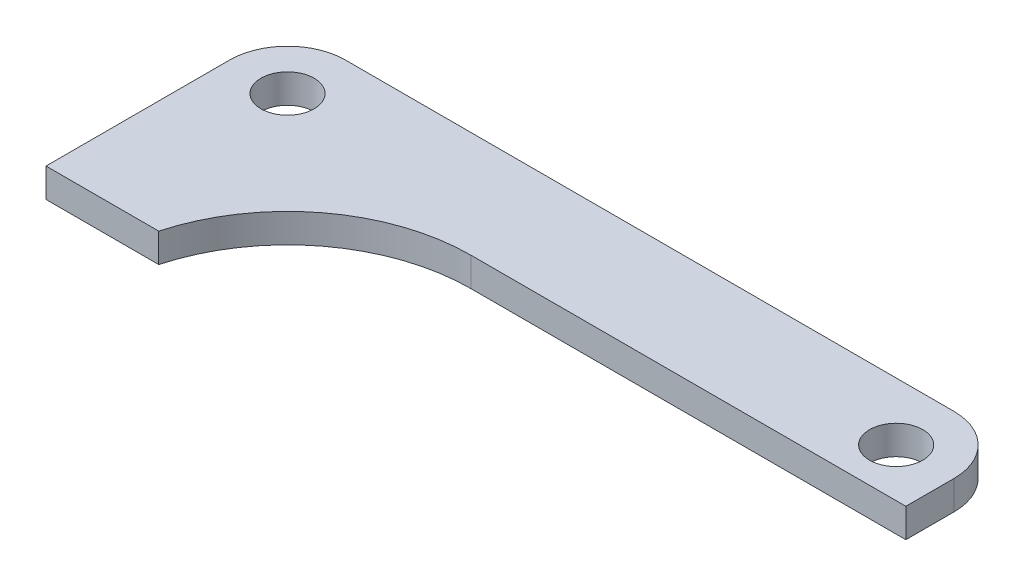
ISO-10303-21;
HEADER;
FILE_DESCRIPTION(('STEP AP214'),'2;1');
FILE_NAME('part.step','',(''),(''),'','','');
FILE_SCHEMA(('AUTOMOTIVE_DESIGN { 1 0 10303 214 1 1 1 1 }'));
ENDSEC;
DATA;
#1=APPLICATION_CONTEXT('core data for automotive mechanical design processes');
#2=APPLICATION_PROTOCOL_DEFINITION('international standard','automotive_design',2000,#1);
#3=PRODUCT_CONTEXT('',#1,'mechanical');
#4=PRODUCT('Part','Part','',(#3));
#5=PRODUCT_RELATED_PRODUCT_CATEGORY('part','',(#4));
#6=PRODUCT_DEFINITION_FORMATION('','',#4);
#7=PRODUCT_DEFINITION_CONTEXT('part definition',#1,'design');
#8=PRODUCT_DEFINITION('design','',#6,#7);
#9=PRODUCT_DEFINITION_SHAPE('','',#8);
#10=(LENGTH_UNIT() NAMED_UNIT(*) SI_UNIT(.MILLI.,.METRE.));
#11=(NAMED_UNIT(*) PLANE_ANGLE_UNIT() SI_UNIT($,.RADIAN.));
#12=(NAMED_UNIT(*) SI_UNIT($,.STERADIAN.) SOLID_ANGLE_UNIT());
#13=UNCERTAINTY_MEASURE_WITH_UNIT(LENGTH_MEASURE(1.E-05),#10,'distance_accuracy_value','');
#14=(GEOMETRIC_REPRESENTATION_CONTEXT(3) GLOBAL_UNCERTAINTY_ASSIGNED_CONTEXT((#13)) GLOBAL_UNIT_ASSIGNED_CONTEXT((#10,
#11,#12)) REPRESENTATION_CONTEXT('',''));
#15=CARTESIAN_POINT('',(0.,0.,0.));
#16=DIRECTION('',(0.,0.,1.));
#17=DIRECTION('',(1.,0.,0.));
#18=AXIS2_PLACEMENT_3D('',#15,#16,#17);
#19=CARTESIAN_POINT('',(6.,3.,-19.));
#20=DIRECTION('',(0.,-1.,0.));
#21=DIRECTION('',(0.,0.,-1.));
#22=AXIS2_PLACEMENT_3D('',#19,#20,#21);
#23=PLANE('',#22);
#24=CARTESIAN_POINT('',(6.,3.,-19.));
#25=DIRECTION('',(0.,1.,0.));
#26=DIRECTION('',(0.,0.,1.));
#27=AXIS2_PLACEMENT_3D('',#24,#25,#26);
#28=CIRCLE('',#27,2.75);
#29=CARTESIAN_POINT('',(6.,3.,-16.25));
#30=VERTEX_POINT('',#29);
#31=EDGE_CURVE('E132',#30,#30,#28,.T.);
#32=ORIENTED_EDGE('',*,*,#31,.F.);
#33=EDGE_LOOP('',(#32));
#34=FACE_BOUND('',#33,.T.);
#35=DIRECTION('',(0.,0.,1.));
#36=VECTOR('',#35,1.);
#37=CARTESIAN_POINT('',(0.,3.,0.));
#38=LINE('',#37,#36);
#39=CARTESIAN_POINT('',(0.,3.,-19.));
#40=VERTEX_POINT('',#39);
#41=CARTESIAN_POINT('',(0.,3.,0.));
#42=VERTEX_POINT('',#41);
#43=EDGE_CURVE('E143',#40,#42,#38,.T.);
#44=ORIENTED_EDGE('',*,*,#43,.T.);
#45=DIRECTION('',(1.,0.,0.));
#46=VECTOR('',#45,1.);
#47=CARTESIAN_POINT('',(0.,3.,0.));
#48=LINE('',#47,#46);
#49=CARTESIAN_POINT('',(11.6696972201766,3.,0.));
#50=VERTEX_POINT('',#49);
#51=EDGE_CURVE('E91',#42,#50,#48,.T.);
#52=ORIENTED_EDGE('',*,*,#51,.T.);
#53=CARTESIAN_POINT('',(30.,3.,5.));
#54=DIRECTION('',(0.,-1.,0.));
#55=DIRECTION('',(0.,0.,1.));
#56=AXIS2_PLACEMENT_3D('',#53,#54,#55);
#57=CIRCLE('',#56,19.);
#58=CARTESIAN_POINT('',(30.,3.,-14.));
#59=VERTEX_POINT('',#58);
#60=EDGE_CURVE('E158',#50,#59,#57,.T.);
#61=ORIENTED_EDGE('',*,*,#60,.T.);
#62=DIRECTION('',(1.,0.,0.));
#63=VECTOR('',#62,1.);
#64=CARTESIAN_POINT('',(30.,3.,-14.));
#65=LINE('',#64,#63);
#66=CARTESIAN_POINT('',(75.,3.,-14.));
#67=VERTEX_POINT('',#66);
#68=EDGE_CURVE('E171',#59,#67,#65,.T.);
#69=ORIENTED_EDGE('',*,*,#68,.T.);
#70=DIRECTION('',(0.,0.,-1.));
#71=VECTOR('',#70,1.);
#72=CARTESIAN_POINT('',(75.,3.,-14.));
#73=LINE('',#72,#71);
#74=CARTESIAN_POINT('',(75.,3.,-19.));
#75=VERTEX_POINT('',#74);
#76=EDGE_CURVE('E110',#67,#75,#73,.T.);
#77=ORIENTED_EDGE('',*,*,#76,.T.);
#78=CARTESIAN_POINT('',(69.,3.,-19.));
#79=DIRECTION('',(0.,1.,0.));
#80=DIRECTION('',(0.,0.,1.));
#81=AXIS2_PLACEMENT_3D('',#78,#79,#80);
#82=CIRCLE('',#81,6.);
#83=CARTESIAN_POINT('',(68.9999999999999,3.,-25.));
#84=VERTEX_POINT('',#83);
#85=EDGE_CURVE('E104',#75,#84,#82,.T.);
#86=ORIENTED_EDGE('',*,*,#85,.T.);
#87=DIRECTION('',(-1.,0.,0.));
#88=VECTOR('',#87,1.);
#89=CARTESIAN_POINT('',(6.00000000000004,3.,-25.));
#90=LINE('',#89,#88);
#91=CARTESIAN_POINT('',(6.00000000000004,3.,-25.));
#92=VERTEX_POINT('',#91);
#93=EDGE_CURVE('E108',#84,#92,#90,.T.);
#94=ORIENTED_EDGE('',*,*,#93,.T.);
#95=CARTESIAN_POINT('',(6.,3.,-19.));
#96=DIRECTION('',(0.,1.,0.));
#97=DIRECTION('',(0.,0.,-1.));
#98=AXIS2_PLACEMENT_3D('',#95,#96,#97);
#99=CIRCLE('',#98,6.);
#100=EDGE_CURVE('E48',#92,#40,#99,.T.);
#101=ORIENTED_EDGE('',*,*,#100,.T.);
#102=EDGE_LOOP('',(#44,#52,#61,#69,#77,#86,#94,#101));
#103=FACE_BOUND('',#102,.T.);
#104=CARTESIAN_POINT('',(69.,3.,-19.));
#105=DIRECTION('',(0.,1.,0.));
#106=DIRECTION('',(0.,0.,1.));
#107=AXIS2_PLACEMENT_3D('',#104,#105,#106);
#108=CIRCLE('',#107,2.75000000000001);
#109=CARTESIAN_POINT('',(69.,3.,-16.25));
#110=VERTEX_POINT('',#109);
#111=EDGE_CURVE('E180',#110,#110,#108,.T.);
#112=ORIENTED_EDGE('',*,*,#111,.F.);
#113=EDGE_LOOP('',(#112));
#114=FACE_BOUND('',#113,.T.);
#115=ADVANCED_FACE('F31',(#34,#103,#114),#23,.F.);
#116=CARTESIAN_POINT('',(6.,0.,-19.));
#117=DIRECTION('',(0.,-1.,0.));
#118=DIRECTION('',(0.,0.,-1.));
#119=AXIS2_PLACEMENT_3D('',#116,#117,#118);
#120=PLANE('',#119);
#121=CARTESIAN_POINT('',(6.,0.,-19.));
#122=DIRECTION('',(0.,1.,0.));
#123=DIRECTION('',(0.,0.,1.));
#124=AXIS2_PLACEMENT_3D('',#121,#122,#123);
#125=CIRCLE('',#124,2.75);
#126=CARTESIAN_POINT('',(6.,0.,-16.25));
#127=VERTEX_POINT('',#126);
#128=EDGE_CURVE('E177',#127,#127,#125,.T.);
#129=ORIENTED_EDGE('',*,*,#128,.T.);
#130=EDGE_LOOP('',(#129));
#131=FACE_BOUND('',#130,.T.);
#132=DIRECTION('',(0.,0.,1.));
#133=VECTOR('',#132,1.);
#134=CARTESIAN_POINT('',(0.,0.,0.));
#135=LINE('',#134,#133);
#136=CARTESIAN_POINT('',(0.,0.,-19.));
#137=VERTEX_POINT('',#136);
#138=CARTESIAN_POINT('',(0.,0.,0.));
#139=VERTEX_POINT('',#138);
#140=EDGE_CURVE('E128',#137,#139,#135,.T.);
#141=ORIENTED_EDGE('',*,*,#140,.F.);
#142=CARTESIAN_POINT('',(6.,0.,-19.));
#143=DIRECTION('',(0.,1.,0.));
#144=DIRECTION('',(0.,0.,-1.));
#145=AXIS2_PLACEMENT_3D('',#142,#143,#144);
#146=CIRCLE('',#145,6.);
#147=CARTESIAN_POINT('',(6.00000000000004,0.,-25.));
#148=VERTEX_POINT('',#147);
#149=EDGE_CURVE('E83',#148,#137,#146,.T.);
#150=ORIENTED_EDGE('',*,*,#149,.F.);
#151=DIRECTION('',(-1.,0.,0.));
#152=VECTOR('',#151,1.);
#153=CARTESIAN_POINT('',(6.00000000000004,0.,-25.));
#154=LINE('',#153,#152);
#155=CARTESIAN_POINT('',(68.9999999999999,0.,-25.));
#156=VERTEX_POINT('',#155);
#157=EDGE_CURVE('E77',#156,#148,#154,.T.);
#158=ORIENTED_EDGE('',*,*,#157,.F.);
#159=CARTESIAN_POINT('',(69.,0.,-19.));
#160=DIRECTION('',(0.,1.,0.));
#161=DIRECTION('',(0.,0.,1.));
#162=AXIS2_PLACEMENT_3D('',#159,#160,#161);
#163=CIRCLE('',#162,6.);
#164=CARTESIAN_POINT('',(75.,0.,-19.));
#165=VERTEX_POINT('',#164);
#166=EDGE_CURVE('E118',#165,#156,#163,.T.);
#167=ORIENTED_EDGE('',*,*,#166,.F.);
#168=DIRECTION('',(0.,0.,-1.));
#169=VECTOR('',#168,1.);
#170=CARTESIAN_POINT('',(75.,0.,-14.));
#171=LINE('',#170,#169);
#172=CARTESIAN_POINT('',(75.,0.,-14.));
#173=VERTEX_POINT('',#172);
#174=EDGE_CURVE('E138',#173,#165,#171,.T.);
#175=ORIENTED_EDGE('',*,*,#174,.F.);
#176=DIRECTION('',(1.,0.,0.));
#177=VECTOR('',#176,1.);
#178=CARTESIAN_POINT('',(30.,0.,-14.));
#179=LINE('',#178,#177);
#180=CARTESIAN_POINT('',(30.,0.,-14.));
#181=VERTEX_POINT('',#180);
#182=EDGE_CURVE('E136',#181,#173,#179,.T.);
#183=ORIENTED_EDGE('',*,*,#182,.F.);
#184=CARTESIAN_POINT('',(30.,0.,5.));
#185=DIRECTION('',(0.,-1.,0.));
#186=DIRECTION('',(0.,0.,1.));
#187=AXIS2_PLACEMENT_3D('',#184,#185,#186);
#188=CIRCLE('',#187,19.);
#189=CARTESIAN_POINT('',(11.6696972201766,0.,0.));
#190=VERTEX_POINT('',#189);
#191=EDGE_CURVE('E134',#190,#181,#188,.T.);
#192=ORIENTED_EDGE('',*,*,#191,.F.);
#193=DIRECTION('',(1.,0.,0.));
#194=VECTOR('',#193,1.);
#195=CARTESIAN_POINT('',(0.,0.,0.));
#196=LINE('',#195,#194);
#197=EDGE_CURVE('E131',#139,#190,#196,.T.);
#198=ORIENTED_EDGE('',*,*,#197,.F.);
#199=EDGE_LOOP('',(#141,#150,#158,#167,#175,#183,#192,#198));
#200=FACE_BOUND('',#199,.T.);
#201=CARTESIAN_POINT('',(69.,0.,-19.));
#202=DIRECTION('',(0.,1.,0.));
#203=DIRECTION('',(0.,0.,1.));
#204=AXIS2_PLACEMENT_3D('',#201,#202,#203);
#205=CIRCLE('',#204,2.75000000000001);
#206=CARTESIAN_POINT('',(69.,0.,-16.25));
#207=VERTEX_POINT('',#206);
#208=EDGE_CURVE('E183',#207,#207,#205,.T.);
#209=ORIENTED_EDGE('',*,*,#208,.T.);
#210=EDGE_LOOP('',(#209));
#211=FACE_BOUND('',#210,.T.);
#212=ADVANCED_FACE('F162',(#131,#200,#211),#120,.T.);
#213=CARTESIAN_POINT('',(0.,3.,0.));
#214=DIRECTION('',(1.,0.,0.));
#215=DIRECTION('',(0.,0.,-1.));
#216=AXIS2_PLACEMENT_3D('',#213,#214,#215);
#217=PLANE('',#216);
#218=ORIENTED_EDGE('',*,*,#140,.T.);
#219=DIRECTION('',(0.,-1.,0.));
#220=VECTOR('',#219,1.);
#221=CARTESIAN_POINT('',(0.,3.,0.));
#222=LINE('',#221,#220);
#223=EDGE_CURVE('E11',#42,#139,#222,.T.);
#224=ORIENTED_EDGE('',*,*,#223,.F.);
#225=ORIENTED_EDGE('',*,*,#43,.F.);
#226=DIRECTION('',(0.,-1.,0.));
#227=VECTOR('',#226,1.);
#228=CARTESIAN_POINT('',(0.,3.,-19.));
#229=LINE('',#228,#227);
#230=EDGE_CURVE('E124',#40,#137,#229,.T.);
#231=ORIENTED_EDGE('',*,*,#230,.T.);
#232=EDGE_LOOP('',(#218,#224,#225,#231));
#233=FACE_BOUND('',#232,.T.);
#234=ADVANCED_FACE('F33',(#233),#217,.F.);
#235=CARTESIAN_POINT('',(0.,3.,0.));
#236=DIRECTION('',(0.,0.,-1.));
#237=DIRECTION('',(-1.,0.,0.));
#238=AXIS2_PLACEMENT_3D('',#235,#236,#237);
#239=PLANE('',#238);
#240=ORIENTED_EDGE('',*,*,#197,.T.);
#241=DIRECTION('',(0.,-1.,0.));
#242=VECTOR('',#241,1.);
#243=CARTESIAN_POINT('',(11.6696972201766,3.,0.));
#244=LINE('',#243,#242);
#245=EDGE_CURVE('E40',#50,#190,#244,.T.);
#246=ORIENTED_EDGE('',*,*,#245,.F.);
#247=ORIENTED_EDGE('',*,*,#51,.F.);
#248=ORIENTED_EDGE('',*,*,#223,.T.);
#249=EDGE_LOOP('',(#240,#246,#247,#248));
#250=FACE_BOUND('',#249,.T.);
#251=ADVANCED_FACE('F216',(#250),#239,.F.);
#252=CARTESIAN_POINT('',(30.,3.,5.));
#253=DIRECTION('',(0.,-1.,0.));
#254=DIRECTION('',(0.,0.,-1.));
#255=AXIS2_PLACEMENT_3D('',#252,#253,#254);
#256=CYLINDRICAL_SURFACE('',#255,19.);
#257=ORIENTED_EDGE('',*,*,#191,.T.);
#258=DIRECTION('',(0.,-1.,0.));
#259=VECTOR('',#258,1.);
#260=CARTESIAN_POINT('',(30.,3.,-14.));
#261=LINE('',#260,#259);
#262=EDGE_CURVE('E150',#59,#181,#261,.T.);
#263=ORIENTED_EDGE('',*,*,#262,.F.);
#264=ORIENTED_EDGE('',*,*,#60,.F.);
#265=ORIENTED_EDGE('',*,*,#245,.T.);
#266=EDGE_LOOP('',(#257,#263,#264,#265));
#267=FACE_BOUND('',#266,.T.);
#268=ADVANCED_FACE('F156',(#267),#256,.F.);
#269=CARTESIAN_POINT('',(30.,3.,-14.));
#270=DIRECTION('',(0.,0.,-1.));
#271=DIRECTION('',(-1.,0.,0.));
#272=AXIS2_PLACEMENT_3D('',#269,#270,#271);
#273=PLANE('',#272);
#274=ORIENTED_EDGE('',*,*,#182,.T.);
#275=DIRECTION('',(0.,-1.,0.));
#276=VECTOR('',#275,1.);
#277=CARTESIAN_POINT('',(75.,3.,-14.));
#278=LINE('',#277,#276);
#279=EDGE_CURVE('E147',#67,#173,#278,.T.);
#280=ORIENTED_EDGE('',*,*,#279,.F.);
#281=ORIENTED_EDGE('',*,*,#68,.F.);
#282=ORIENTED_EDGE('',*,*,#262,.T.);
#283=EDGE_LOOP('',(#274,#280,#281,#282));
#284=FACE_BOUND('',#283,.T.);
#285=ADVANCED_FACE('F167',(#284),#273,.F.);
#286=CARTESIAN_POINT('',(75.,3.,-14.));
#287=DIRECTION('',(-1.,0.,0.));
#288=DIRECTION('',(0.,0.,1.));
#289=AXIS2_PLACEMENT_3D('',#286,#287,#288);
#290=PLANE('',#289);
#291=ORIENTED_EDGE('',*,*,#174,.T.);
#292=DIRECTION('',(0.,-1.,0.));
#293=VECTOR('',#292,1.);
#294=CARTESIAN_POINT('',(75.,3.,-19.));
#295=LINE('',#294,#293);
#296=EDGE_CURVE('E119',#75,#165,#295,.T.);
#297=ORIENTED_EDGE('',*,*,#296,.F.);
#298=ORIENTED_EDGE('',*,*,#76,.F.);
#299=ORIENTED_EDGE('',*,*,#279,.T.);
#300=EDGE_LOOP('',(#291,#297,#298,#299));
#301=FACE_BOUND('',#300,.T.);
#302=ADVANCED_FACE('F170',(#301),#290,.F.);
#303=CARTESIAN_POINT('',(69.,3.,-19.));
#304=DIRECTION('',(0.,-1.,0.));
#305=DIRECTION('',(0.,0.,-1.));
#306=AXIS2_PLACEMENT_3D('',#303,#304,#305);
#307=CYLINDRICAL_SURFACE('',#306,6.);
#308=ORIENTED_EDGE('',*,*,#166,.T.);
#309=DIRECTION('',(0.,-1.,0.));
#310=VECTOR('',#309,1.);
#311=CARTESIAN_POINT('',(68.9999999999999,3.,-25.));
#312=LINE('',#311,#310);
#313=EDGE_CURVE('E115',#84,#156,#312,.T.);
#314=ORIENTED_EDGE('',*,*,#313,.F.);
#315=ORIENTED_EDGE('',*,*,#85,.F.);
#316=ORIENTED_EDGE('',*,*,#296,.T.);
#317=EDGE_LOOP('',(#308,#314,#315,#316));
#318=FACE_BOUND('',#317,.T.);
#319=ADVANCED_FACE('F116',(#318),#307,.T.);
#320=CARTESIAN_POINT('',(6.00000000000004,3.,-25.));
#321=DIRECTION('',(0.,0.,1.));
#322=DIRECTION('',(1.,0.,0.));
#323=AXIS2_PLACEMENT_3D('',#320,#321,#322);
#324=PLANE('',#323);
#325=ORIENTED_EDGE('',*,*,#157,.T.);
#326=DIRECTION('',(0.,-1.,0.));
#327=VECTOR('',#326,1.);
#328=CARTESIAN_POINT('',(6.00000000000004,3.,-25.));
#329=LINE('',#328,#327);
#330=EDGE_CURVE('E120',#92,#148,#329,.T.);
#331=ORIENTED_EDGE('',*,*,#330,.F.);
#332=ORIENTED_EDGE('',*,*,#93,.F.);
#333=ORIENTED_EDGE('',*,*,#313,.T.);
#334=EDGE_LOOP('',(#325,#331,#332,#333));
#335=FACE_BOUND('',#334,.T.);
#336=ADVANCED_FACE('F122',(#335),#324,.F.);
#337=CARTESIAN_POINT('',(6.,3.,-19.));
#338=DIRECTION('',(0.,-1.,0.));
#339=DIRECTION('',(0.,0.,-1.));
#340=AXIS2_PLACEMENT_3D('',#337,#338,#339);
#341=CYLINDRICAL_SURFACE('',#340,6.);
#342=ORIENTED_EDGE('',*,*,#149,.T.);
#343=ORIENTED_EDGE('',*,*,#230,.F.);
#344=ORIENTED_EDGE('',*,*,#100,.F.);
#345=ORIENTED_EDGE('',*,*,#330,.T.);
#346=EDGE_LOOP('',(#342,#343,#344,#345));
#347=FACE_BOUND('',#346,.T.);
#348=ADVANCED_FACE('F204',(#347),#341,.T.);
#349=CARTESIAN_POINT('',(6.,3.,-19.));
#350=DIRECTION('',(0.,-1.,0.));
#351=DIRECTION('',(0.,0.,-1.));
#352=AXIS2_PLACEMENT_3D('',#349,#350,#351);
#353=CYLINDRICAL_SURFACE('',#352,2.75);
#354=ORIENTED_EDGE('',*,*,#31,.T.);
#355=EDGE_LOOP('',(#354));
#356=FACE_BOUND('',#355,.T.);
#357=ORIENTED_EDGE('',*,*,#128,.F.);
#358=EDGE_LOOP('',(#357));
#359=FACE_BOUND('',#358,.T.);
#360=ADVANCED_FACE('F201',(#356,#359),#353,.F.);
#361=CARTESIAN_POINT('',(69.,3.,-19.));
#362=DIRECTION('',(0.,-1.,0.));
#363=DIRECTION('',(0.,0.,-1.));
#364=AXIS2_PLACEMENT_3D('',#361,#362,#363);
#365=CYLINDRICAL_SURFACE('',#364,2.75000000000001);
#366=ORIENTED_EDGE('',*,*,#111,.T.);
#367=EDGE_LOOP('',(#366));
#368=FACE_BOUND('',#367,.T.);
#369=ORIENTED_EDGE('',*,*,#208,.F.);
#370=EDGE_LOOP('',(#369));
#371=FACE_BOUND('',#370,.T.);
#372=ADVANCED_FACE('F189',(#368,#371),#365,.F.);
#373=CLOSED_SHELL('',(#115,#212,#234,#251,#268,#285,#302,#319,#336,#348,#360,#372));
#374=MANIFOLD_SOLID_BREP('B2',#373);
#375=ADVANCED_BREP_SHAPE_REPRESENTATION('',(#18,#374),#14);
#376=SHAPE_DEFINITION_REPRESENTATION(#9,#375);
ENDSEC;
END-ISO-10303-21;
